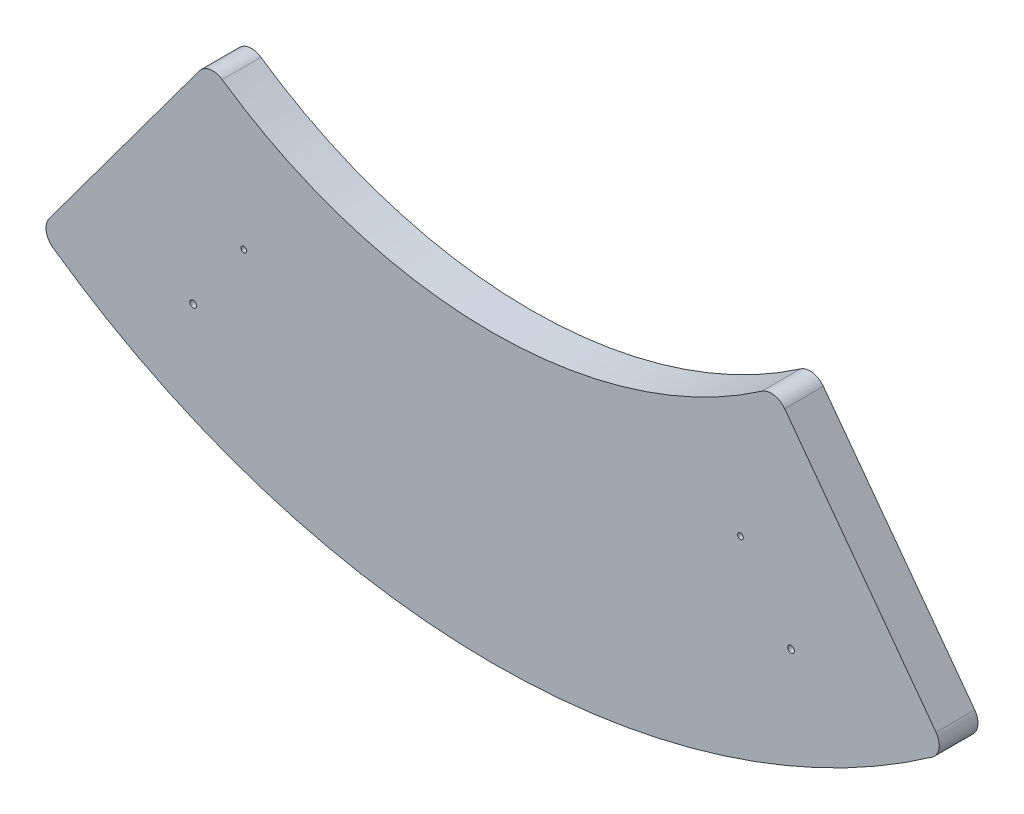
ISO-10303-21;
HEADER;
FILE_DESCRIPTION(('STEP AP214'),'2;1');
FILE_NAME('part.step','',(''),(''),'','','');
FILE_SCHEMA(('AUTOMOTIVE_DESIGN { 1 0 10303 214 1 1 1 1 }'));
ENDSEC;
DATA;
#1=APPLICATION_CONTEXT('core data for automotive mechanical design processes');
#2=APPLICATION_PROTOCOL_DEFINITION('international standard','automotive_design',2000,#1);
#3=PRODUCT_CONTEXT('',#1,'mechanical');
#4=PRODUCT('Part','Part','',(#3));
#5=PRODUCT_RELATED_PRODUCT_CATEGORY('part','',(#4));
#6=PRODUCT_DEFINITION_FORMATION('','',#4);
#7=PRODUCT_DEFINITION_CONTEXT('part definition',#1,'design');
#8=PRODUCT_DEFINITION('design','',#6,#7);
#9=PRODUCT_DEFINITION_SHAPE('','',#8);
#10=(LENGTH_UNIT() NAMED_UNIT(*) SI_UNIT(.MILLI.,.METRE.));
#11=(NAMED_UNIT(*) PLANE_ANGLE_UNIT() SI_UNIT($,.RADIAN.));
#12=(NAMED_UNIT(*) SI_UNIT($,.STERADIAN.) SOLID_ANGLE_UNIT());
#13=UNCERTAINTY_MEASURE_WITH_UNIT(LENGTH_MEASURE(1.E-05),#10,'distance_accuracy_value','');
#14=(GEOMETRIC_REPRESENTATION_CONTEXT(3) GLOBAL_UNCERTAINTY_ASSIGNED_CONTEXT((#13)) GLOBAL_UNIT_ASSIGNED_CONTEXT((#10,
#11,#12)) REPRESENTATION_CONTEXT('',''));
#15=CARTESIAN_POINT('',(0.,0.,0.));
#16=DIRECTION('',(0.,0.,1.));
#17=DIRECTION('',(1.,0.,0.));
#18=AXIS2_PLACEMENT_3D('',#15,#16,#17);
#19=CARTESIAN_POINT('',(-1.18350209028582,36.6623095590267,35.));
#20=DIRECTION('',(0.,0.,1.));
#21=DIRECTION('',(1.,0.,0.));
#22=AXIS2_PLACEMENT_3D('',#19,#20,#21);
#23=PLANE('',#22);
#24=CARTESIAN_POINT('',(269.130497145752,-506.272349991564,35.));
#25=DIRECTION('',(0.,0.,1.));
#26=DIRECTION('',(1.,0.,0.));
#27=AXIS2_PLACEMENT_3D('',#24,#25,#26);
#28=CIRCLE('',#27,3.00000000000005);
#29=CARTESIAN_POINT('',(272.130497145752,-506.272349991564,35.));
#30=VERTEX_POINT('',#29);
#31=EDGE_CURVE('E185',#30,#30,#28,.T.);
#32=ORIENTED_EDGE('',*,*,#31,.F.);
#33=EDGE_LOOP('',(#32));
#34=FACE_BOUND('',#33,.T.);
#35=CARTESIAN_POINT('',(-271.388064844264,-506.272349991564,35.));
#36=DIRECTION('',(0.,0.,1.));
#37=DIRECTION('',(1.,0.,0.));
#38=AXIS2_PLACEMENT_3D('',#35,#36,#37);
#39=CIRCLE('',#38,2.99999999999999);
#40=CARTESIAN_POINT('',(-268.388064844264,-506.272349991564,35.));
#41=VERTEX_POINT('',#40);
#42=EDGE_CURVE('E179',#41,#41,#39,.T.);
#43=ORIENTED_EDGE('',*,*,#42,.F.);
#44=EDGE_LOOP('',(#43));
#45=FACE_BOUND('',#44,.T.);
#46=CARTESIAN_POINT('',(-225.628933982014,-440.651454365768,35.));
#47=DIRECTION('',(0.,0.,1.));
#48=DIRECTION('',(1.,0.,0.));
#49=AXIS2_PLACEMENT_3D('',#46,#47,#48);
#50=CIRCLE('',#49,2.59999999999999);
#51=CARTESIAN_POINT('',(-223.028933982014,-440.651454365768,35.));
#52=VERTEX_POINT('',#51);
#53=EDGE_CURVE('E159',#52,#52,#50,.T.);
#54=ORIENTED_EDGE('',*,*,#53,.F.);
#55=EDGE_LOOP('',(#54));
#56=FACE_BOUND('',#55,.T.);
#57=CARTESIAN_POINT('',(0.342863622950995,37.7885172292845,35.));
#58=DIRECTION('',(0.,0.,1.));
#59=DIRECTION('',(-1.,0.,0.));
#60=AXIS2_PLACEMENT_3D('',#57,#58,#59);
#61=CIRCLE('',#60,690.);
#62=CARTESIAN_POINT('',(-398.122859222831,-525.527617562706,35.));
#63=VERTEX_POINT('',#62);
#64=CARTESIAN_POINT('',(396.757470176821,-526.972901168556,35.));
#65=VERTEX_POINT('',#64);
#66=EDGE_CURVE('E163',#63,#65,#61,.T.);
#67=ORIENTED_EDGE('',*,*,#66,.T.);
#68=CARTESIAN_POINT('',(388.139761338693,-514.695479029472,35.));
#69=DIRECTION('',(0.,0.,1.));
#70=DIRECTION('',(1.,0.,0.));
#71=AXIS2_PLACEMENT_3D('',#68,#69,#70);
#72=CIRCLE('',#71,15.);
#73=CARTESIAN_POINT('',(400.197614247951,-505.773137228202,35.));
#74=VERTEX_POINT('',#73);
#75=EDGE_CURVE('E146',#65,#74,#72,.T.);
#76=ORIENTED_EDGE('',*,*,#75,.T.);
#77=DIRECTION('',(-0.594822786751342,0.803856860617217,0.));
#78=VECTOR('',#77,1.);
#79=CARTESIAN_POINT('',(254.590296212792,-308.996140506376,35.));
#80=LINE('',#79,#78);
#81=CARTESIAN_POINT('',(263.362218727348,-320.850713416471,35.));
#82=VERTEX_POINT('',#81);
#83=EDGE_CURVE('E117',#74,#82,#80,.T.);
#84=ORIENTED_EDGE('',*,*,#83,.T.);
#85=CARTESIAN_POINT('',(251.30436581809,-329.773055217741,35.));
#86=DIRECTION('',(0.,0.,1.));
#87=DIRECTION('',(1.,0.,0.));
#88=AXIS2_PLACEMENT_3D('',#85,#86,#87);
#89=CIRCLE('',#88,15.);
#90=CARTESIAN_POINT('',(242.793538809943,-317.421301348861,35.));
#91=VERTEX_POINT('',#90);
#92=EDGE_CURVE('E144',#82,#91,#89,.T.);
#93=ORIENTED_EDGE('',*,*,#92,.T.);
#94=CARTESIAN_POINT('',(-1.18350209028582,36.6623095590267,35.));
#95=DIRECTION('',(0.,0.,-1.));
#96=DIRECTION('',(1.,0.,0.));
#97=AXIS2_PLACEMENT_3D('',#94,#95,#96);
#98=CIRCLE('',#97,430.);
#99=CARTESIAN_POINT('',(-245.160542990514,-317.421301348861,35.));
#100=VERTEX_POINT('',#99);
#101=EDGE_CURVE('E124',#91,#100,#98,.T.);
#102=ORIENTED_EDGE('',*,*,#101,.T.);
#103=CARTESIAN_POINT('',(-253.671369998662,-329.773055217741,35.));
#104=DIRECTION('',(0.,0.,1.));
#105=DIRECTION('',(1.,0.,0.));
#106=AXIS2_PLACEMENT_3D('',#103,#104,#105);
#107=CIRCLE('',#106,15.);
#108=CARTESIAN_POINT('',(-265.72922290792,-320.850713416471,35.));
#109=VERTEX_POINT('',#108);
#110=EDGE_CURVE('E52',#100,#109,#107,.T.);
#111=ORIENTED_EDGE('',*,*,#110,.T.);
#112=DIRECTION('',(-0.594822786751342,-0.803856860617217,0.));
#113=VECTOR('',#112,1.);
#114=CARTESIAN_POINT('',(-256.957300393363,-308.996140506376,35.));
#115=LINE('',#114,#113);
#116=CARTESIAN_POINT('',(-401.518413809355,-504.359272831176,35.));
#117=VERTEX_POINT('',#116);
#118=EDGE_CURVE('E127',#109,#117,#115,.T.);
#119=ORIENTED_EDGE('',*,*,#118,.T.);
#120=CARTESIAN_POINT('',(-389.460560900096,-513.281614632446,35.));
#121=DIRECTION('',(0.,0.,1.));
#122=DIRECTION('',(1.,0.,0.));
#123=AXIS2_PLACEMENT_3D('',#120,#121,#122);
#124=CIRCLE('',#123,15.);
#125=EDGE_CURVE('E142',#117,#63,#124,.T.);
#126=ORIENTED_EDGE('',*,*,#125,.T.);
#127=EDGE_LOOP('',(#67,#76,#84,#93,#102,#111,#119,#126));
#128=FACE_BOUND('',#127,.T.);
#129=CARTESIAN_POINT('',(223.371366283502,-440.651454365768,35.));
#130=DIRECTION('',(0.,0.,1.));
#131=DIRECTION('',(1.,0.,0.));
#132=AXIS2_PLACEMENT_3D('',#129,#130,#131);
#133=CIRCLE('',#132,2.59999999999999);
#134=CARTESIAN_POINT('',(225.971366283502,-440.651454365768,35.));
#135=VERTEX_POINT('',#134);
#136=EDGE_CURVE('E170',#135,#135,#133,.T.);
#137=ORIENTED_EDGE('',*,*,#136,.F.);
#138=EDGE_LOOP('',(#137));
#139=FACE_BOUND('',#138,.T.);
#140=ADVANCED_FACE('F32',(#34,#45,#56,#128,#139),#23,.T.);
#141=CARTESIAN_POINT('',(-1.18350209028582,36.6623095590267,0.));
#142=DIRECTION('',(0.,0.,1.));
#143=DIRECTION('',(1.,0.,0.));
#144=AXIS2_PLACEMENT_3D('',#141,#142,#143);
#145=PLANE('',#144);
#146=CARTESIAN_POINT('',(269.130497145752,-506.272349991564,0.));
#147=DIRECTION('',(0.,0.,1.));
#148=DIRECTION('',(1.,0.,0.));
#149=AXIS2_PLACEMENT_3D('',#146,#147,#148);
#150=CIRCLE('',#149,3.00000000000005);
#151=CARTESIAN_POINT('',(272.130497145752,-506.272349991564,0.));
#152=VERTEX_POINT('',#151);
#153=EDGE_CURVE('E182',#152,#152,#150,.T.);
#154=ORIENTED_EDGE('',*,*,#153,.T.);
#155=EDGE_LOOP('',(#154));
#156=FACE_BOUND('',#155,.T.);
#157=CARTESIAN_POINT('',(-271.388064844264,-506.272349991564,0.));
#158=DIRECTION('',(0.,0.,1.));
#159=DIRECTION('',(1.,0.,0.));
#160=AXIS2_PLACEMENT_3D('',#157,#158,#159);
#161=CIRCLE('',#160,2.99999999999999);
#162=CARTESIAN_POINT('',(-268.388064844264,-506.272349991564,0.));
#163=VERTEX_POINT('',#162);
#164=EDGE_CURVE('E176',#163,#163,#161,.T.);
#165=ORIENTED_EDGE('',*,*,#164,.T.);
#166=EDGE_LOOP('',(#165));
#167=FACE_BOUND('',#166,.T.);
#168=CARTESIAN_POINT('',(-225.628933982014,-440.651454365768,0.));
#169=DIRECTION('',(0.,0.,1.));
#170=DIRECTION('',(1.,0.,0.));
#171=AXIS2_PLACEMENT_3D('',#168,#169,#170);
#172=CIRCLE('',#171,2.59999999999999);
#173=CARTESIAN_POINT('',(-223.028933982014,-440.651454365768,0.));
#174=VERTEX_POINT('',#173);
#175=EDGE_CURVE('E167',#174,#174,#172,.T.);
#176=ORIENTED_EDGE('',*,*,#175,.T.);
#177=EDGE_LOOP('',(#176));
#178=FACE_BOUND('',#177,.T.);
#179=DIRECTION('',(-0.594822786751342,0.803856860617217,0.));
#180=VECTOR('',#179,1.);
#181=CARTESIAN_POINT('',(254.590296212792,-308.996140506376,0.));
#182=LINE('',#181,#180);
#183=CARTESIAN_POINT('',(400.197614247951,-505.773137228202,0.));
#184=VERTEX_POINT('',#183);
#185=CARTESIAN_POINT('',(263.362218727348,-320.850713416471,0.));
#186=VERTEX_POINT('',#185);
#187=EDGE_CURVE('E114',#184,#186,#182,.T.);
#188=ORIENTED_EDGE('',*,*,#187,.F.);
#189=CARTESIAN_POINT('',(388.139761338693,-514.695479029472,0.));
#190=DIRECTION('',(0.,0.,1.));
#191=DIRECTION('',(1.,0.,0.));
#192=AXIS2_PLACEMENT_3D('',#189,#190,#191);
#193=CIRCLE('',#192,15.);
#194=CARTESIAN_POINT('',(396.757470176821,-526.972901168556,0.));
#195=VERTEX_POINT('',#194);
#196=EDGE_CURVE('E97',#184,#195,#193,.F.);
#197=ORIENTED_EDGE('',*,*,#196,.T.);
#198=CARTESIAN_POINT('',(0.342863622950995,37.7885172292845,0.));
#199=DIRECTION('',(0.,0.,1.));
#200=DIRECTION('',(-1.,0.,0.));
#201=AXIS2_PLACEMENT_3D('',#198,#199,#200);
#202=CIRCLE('',#201,690.);
#203=CARTESIAN_POINT('',(-398.122859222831,-525.527617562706,0.));
#204=VERTEX_POINT('',#203);
#205=EDGE_CURVE('E125',#204,#195,#202,.T.);
#206=ORIENTED_EDGE('',*,*,#205,.F.);
#207=CARTESIAN_POINT('',(-389.460560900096,-513.281614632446,0.));
#208=DIRECTION('',(0.,0.,1.));
#209=DIRECTION('',(1.,0.,0.));
#210=AXIS2_PLACEMENT_3D('',#207,#208,#209);
#211=CIRCLE('',#210,15.);
#212=CARTESIAN_POINT('',(-401.518413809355,-504.359272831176,0.));
#213=VERTEX_POINT('',#212);
#214=EDGE_CURVE('E135',#204,#213,#211,.F.);
#215=ORIENTED_EDGE('',*,*,#214,.T.);
#216=DIRECTION('',(-0.594822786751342,-0.803856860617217,0.));
#217=VECTOR('',#216,1.);
#218=CARTESIAN_POINT('',(-256.957300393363,-308.996140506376,0.));
#219=LINE('',#218,#217);
#220=CARTESIAN_POINT('',(-265.72922290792,-320.850713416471,0.));
#221=VERTEX_POINT('',#220);
#222=EDGE_CURVE('E129',#221,#213,#219,.T.);
#223=ORIENTED_EDGE('',*,*,#222,.F.);
#224=CARTESIAN_POINT('',(-253.671369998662,-329.773055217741,0.));
#225=DIRECTION('',(0.,0.,1.));
#226=DIRECTION('',(1.,0.,0.));
#227=AXIS2_PLACEMENT_3D('',#224,#225,#226);
#228=CIRCLE('',#227,15.);
#229=CARTESIAN_POINT('',(-245.160542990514,-317.421301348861,0.));
#230=VERTEX_POINT('',#229);
#231=EDGE_CURVE('E118',#221,#230,#228,.F.);
#232=ORIENTED_EDGE('',*,*,#231,.T.);
#233=CARTESIAN_POINT('',(-1.18350209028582,36.6623095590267,0.));
#234=DIRECTION('',(0.,0.,-1.));
#235=DIRECTION('',(1.,0.,0.));
#236=AXIS2_PLACEMENT_3D('',#233,#234,#235);
#237=CIRCLE('',#236,430.);
#238=CARTESIAN_POINT('',(242.793538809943,-317.421301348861,0.));
#239=VERTEX_POINT('',#238);
#240=EDGE_CURVE('E158',#239,#230,#237,.T.);
#241=ORIENTED_EDGE('',*,*,#240,.F.);
#242=CARTESIAN_POINT('',(251.30436581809,-329.773055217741,0.));
#243=DIRECTION('',(0.,0.,1.));
#244=DIRECTION('',(1.,0.,0.));
#245=AXIS2_PLACEMENT_3D('',#242,#243,#244);
#246=CIRCLE('',#245,15.);
#247=EDGE_CURVE('E108',#239,#186,#246,.F.);
#248=ORIENTED_EDGE('',*,*,#247,.T.);
#249=EDGE_LOOP('',(#188,#197,#206,#215,#223,#232,#241,#248));
#250=FACE_BOUND('',#249,.T.);
#251=CARTESIAN_POINT('',(223.371366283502,-440.651454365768,0.));
#252=DIRECTION('',(0.,0.,1.));
#253=DIRECTION('',(1.,0.,0.));
#254=AXIS2_PLACEMENT_3D('',#251,#252,#253);
#255=CIRCLE('',#254,2.59999999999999);
#256=CARTESIAN_POINT('',(225.971366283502,-440.651454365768,0.));
#257=VERTEX_POINT('',#256);
#258=EDGE_CURVE('E173',#257,#257,#255,.T.);
#259=ORIENTED_EDGE('',*,*,#258,.T.);
#260=EDGE_LOOP('',(#259));
#261=FACE_BOUND('',#260,.T.);
#262=ADVANCED_FACE('F121',(#156,#167,#178,#250,#261),#145,.F.);
#263=CARTESIAN_POINT('',(-1.18350209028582,36.6623095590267,35.));
#264=DIRECTION('',(0.,0.,-1.));
#265=DIRECTION('',(-1.,0.,0.));
#266=AXIS2_PLACEMENT_3D('',#263,#264,#265);
#267=CYLINDRICAL_SURFACE('',#266,430.);
#268=ORIENTED_EDGE('',*,*,#101,.F.);
#269=DIRECTION('',(0.,0.,-1.));
#270=VECTOR('',#269,1.);
#271=CARTESIAN_POINT('',(242.793538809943,-317.421301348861,35.));
#272=LINE('',#271,#270);
#273=EDGE_CURVE('E150',#91,#239,#272,.T.);
#274=ORIENTED_EDGE('',*,*,#273,.T.);
#275=ORIENTED_EDGE('',*,*,#240,.T.);
#276=DIRECTION('',(0.,0.,-1.));
#277=VECTOR('',#276,1.);
#278=CARTESIAN_POINT('',(-245.160542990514,-317.421301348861,35.));
#279=LINE('',#278,#277);
#280=EDGE_CURVE('E148',#230,#100,#279,.F.);
#281=ORIENTED_EDGE('',*,*,#280,.T.);
#282=EDGE_LOOP('',(#268,#274,#275,#281));
#283=FACE_BOUND('',#282,.T.);
#284=ADVANCED_FACE('F217',(#283),#267,.F.);
#285=CARTESIAN_POINT('',(-256.957300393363,-308.996140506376,35.));
#286=DIRECTION('',(0.803856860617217,-0.594822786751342,0.));
#287=DIRECTION('',(0.594822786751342,0.803856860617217,0.));
#288=AXIS2_PLACEMENT_3D('',#285,#286,#287);
#289=PLANE('',#288);
#290=ORIENTED_EDGE('',*,*,#222,.T.);
#291=DIRECTION('',(0.,0.,-1.));
#292=VECTOR('',#291,1.);
#293=CARTESIAN_POINT('',(-401.518413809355,-504.359272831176,35.));
#294=LINE('',#293,#292);
#295=EDGE_CURVE('E11',#213,#117,#294,.F.);
#296=ORIENTED_EDGE('',*,*,#295,.T.);
#297=ORIENTED_EDGE('',*,*,#118,.F.);
#298=DIRECTION('',(0.,0.,-1.));
#299=VECTOR('',#298,1.);
#300=CARTESIAN_POINT('',(-265.72922290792,-320.850713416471,35.));
#301=LINE('',#300,#299);
#302=EDGE_CURVE('E40',#109,#221,#301,.T.);
#303=ORIENTED_EDGE('',*,*,#302,.T.);
#304=EDGE_LOOP('',(#290,#296,#297,#303));
#305=FACE_BOUND('',#304,.T.);
#306=ADVANCED_FACE('F155',(#305),#289,.F.);
#307=CARTESIAN_POINT('',(0.342863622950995,37.7885172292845,35.));
#308=DIRECTION('',(0.,0.,-1.));
#309=DIRECTION('',(-1.,0.,0.));
#310=AXIS2_PLACEMENT_3D('',#307,#308,#309);
#311=CYLINDRICAL_SURFACE('',#310,690.);
#312=ORIENTED_EDGE('',*,*,#205,.T.);
#313=DIRECTION('',(0.,0.,-1.));
#314=VECTOR('',#313,1.);
#315=CARTESIAN_POINT('',(396.757470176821,-526.972901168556,35.));
#316=LINE('',#315,#314);
#317=EDGE_CURVE('E102',#195,#65,#316,.F.);
#318=ORIENTED_EDGE('',*,*,#317,.T.);
#319=ORIENTED_EDGE('',*,*,#66,.F.);
#320=DIRECTION('',(0.,0.,-1.));
#321=VECTOR('',#320,1.);
#322=CARTESIAN_POINT('',(-398.122859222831,-525.527617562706,35.));
#323=LINE('',#322,#321);
#324=EDGE_CURVE('E107',#63,#204,#323,.T.);
#325=ORIENTED_EDGE('',*,*,#324,.T.);
#326=EDGE_LOOP('',(#312,#318,#319,#325));
#327=FACE_BOUND('',#326,.T.);
#328=ADVANCED_FACE('F228',(#327),#311,.T.);
#329=CARTESIAN_POINT('',(254.590296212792,-308.996140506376,35.));
#330=DIRECTION('',(-0.803856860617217,-0.594822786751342,0.));
#331=DIRECTION('',(0.594822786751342,-0.803856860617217,0.));
#332=AXIS2_PLACEMENT_3D('',#329,#330,#331);
#333=PLANE('',#332);
#334=ORIENTED_EDGE('',*,*,#83,.F.);
#335=DIRECTION('',(0.,0.,-1.));
#336=VECTOR('',#335,1.);
#337=CARTESIAN_POINT('',(400.197614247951,-505.773137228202,35.));
#338=LINE('',#337,#336);
#339=EDGE_CURVE('E101',#74,#184,#338,.T.);
#340=ORIENTED_EDGE('',*,*,#339,.T.);
#341=ORIENTED_EDGE('',*,*,#187,.T.);
#342=DIRECTION('',(0.,0.,-1.));
#343=VECTOR('',#342,1.);
#344=CARTESIAN_POINT('',(263.362218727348,-320.850713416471,35.));
#345=LINE('',#344,#343);
#346=EDGE_CURVE('E119',#186,#82,#345,.F.);
#347=ORIENTED_EDGE('',*,*,#346,.T.);
#348=EDGE_LOOP('',(#334,#340,#341,#347));
#349=FACE_BOUND('',#348,.T.);
#350=ADVANCED_FACE('F113',(#349),#333,.F.);
#351=CARTESIAN_POINT('',(-225.628933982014,-440.651454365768,35.));
#352=DIRECTION('',(0.,0.,-1.));
#353=DIRECTION('',(-1.,0.,0.));
#354=AXIS2_PLACEMENT_3D('',#351,#352,#353);
#355=CYLINDRICAL_SURFACE('',#354,2.59999999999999);
#356=ORIENTED_EDGE('',*,*,#53,.T.);
#357=EDGE_LOOP('',(#356));
#358=FACE_BOUND('',#357,.T.);
#359=ORIENTED_EDGE('',*,*,#175,.F.);
#360=EDGE_LOOP('',(#359));
#361=FACE_BOUND('',#360,.T.);
#362=ADVANCED_FACE('F213',(#358,#361),#355,.F.);
#363=CARTESIAN_POINT('',(223.371366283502,-440.651454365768,35.));
#364=DIRECTION('',(0.,0.,-1.));
#365=DIRECTION('',(-1.,0.,0.));
#366=AXIS2_PLACEMENT_3D('',#363,#364,#365);
#367=CYLINDRICAL_SURFACE('',#366,2.59999999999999);
#368=ORIENTED_EDGE('',*,*,#136,.T.);
#369=EDGE_LOOP('',(#368));
#370=FACE_BOUND('',#369,.T.);
#371=ORIENTED_EDGE('',*,*,#258,.F.);
#372=EDGE_LOOP('',(#371));
#373=FACE_BOUND('',#372,.T.);
#374=ADVANCED_FACE('F210',(#370,#373),#367,.F.);
#375=CARTESIAN_POINT('',(388.139761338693,-514.695479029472,35.));
#376=DIRECTION('',(0.,0.,-1.));
#377=DIRECTION('',(-1.,0.,0.));
#378=AXIS2_PLACEMENT_3D('',#375,#376,#377);
#379=CYLINDRICAL_SURFACE('',#378,15.);
#380=ORIENTED_EDGE('',*,*,#75,.F.);
#381=ORIENTED_EDGE('',*,*,#317,.F.);
#382=ORIENTED_EDGE('',*,*,#196,.F.);
#383=ORIENTED_EDGE('',*,*,#339,.F.);
#384=EDGE_LOOP('',(#380,#381,#382,#383));
#385=FACE_BOUND('',#384,.T.);
#386=ADVANCED_FACE('F100',(#385),#379,.T.);
#387=CARTESIAN_POINT('',(251.30436581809,-329.773055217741,35.));
#388=DIRECTION('',(0.,0.,-1.));
#389=DIRECTION('',(-1.,0.,0.));
#390=AXIS2_PLACEMENT_3D('',#387,#388,#389);
#391=CYLINDRICAL_SURFACE('',#390,15.);
#392=ORIENTED_EDGE('',*,*,#92,.F.);
#393=ORIENTED_EDGE('',*,*,#346,.F.);
#394=ORIENTED_EDGE('',*,*,#247,.F.);
#395=ORIENTED_EDGE('',*,*,#273,.F.);
#396=EDGE_LOOP('',(#392,#393,#394,#395));
#397=FACE_BOUND('',#396,.T.);
#398=ADVANCED_FACE('F236',(#397),#391,.T.);
#399=CARTESIAN_POINT('',(-389.460560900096,-513.281614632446,35.));
#400=DIRECTION('',(0.,0.,-1.));
#401=DIRECTION('',(-1.,0.,0.));
#402=AXIS2_PLACEMENT_3D('',#399,#400,#401);
#403=CYLINDRICAL_SURFACE('',#402,15.);
#404=ORIENTED_EDGE('',*,*,#125,.F.);
#405=ORIENTED_EDGE('',*,*,#295,.F.);
#406=ORIENTED_EDGE('',*,*,#214,.F.);
#407=ORIENTED_EDGE('',*,*,#324,.F.);
#408=EDGE_LOOP('',(#404,#405,#406,#407));
#409=FACE_BOUND('',#408,.T.);
#410=ADVANCED_FACE('F238',(#409),#403,.T.);
#411=CARTESIAN_POINT('',(-253.671369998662,-329.773055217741,35.));
#412=DIRECTION('',(0.,0.,-1.));
#413=DIRECTION('',(-1.,0.,0.));
#414=AXIS2_PLACEMENT_3D('',#411,#412,#413);
#415=CYLINDRICAL_SURFACE('',#414,15.);
#416=ORIENTED_EDGE('',*,*,#110,.F.);
#417=ORIENTED_EDGE('',*,*,#280,.F.);
#418=ORIENTED_EDGE('',*,*,#231,.F.);
#419=ORIENTED_EDGE('',*,*,#302,.F.);
#420=EDGE_LOOP('',(#416,#417,#418,#419));
#421=FACE_BOUND('',#420,.T.);
#422=ADVANCED_FACE('F34',(#421),#415,.T.);
#423=CARTESIAN_POINT('',(-271.388064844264,-506.272349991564,0.));
#424=DIRECTION('',(0.,0.,1.));
#425=DIRECTION('',(1.,0.,0.));
#426=AXIS2_PLACEMENT_3D('',#423,#424,#425);
#427=CYLINDRICAL_SURFACE('',#426,2.99999999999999);
#428=ORIENTED_EDGE('',*,*,#164,.F.);
#429=EDGE_LOOP('',(#428));
#430=FACE_BOUND('',#429,.T.);
#431=ORIENTED_EDGE('',*,*,#42,.T.);
#432=EDGE_LOOP('',(#431));
#433=FACE_BOUND('',#432,.T.);
#434=ADVANCED_FACE('F196',(#430,#433),#427,.F.);
#435=CARTESIAN_POINT('',(269.130497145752,-506.272349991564,0.));
#436=DIRECTION('',(0.,0.,1.));
#437=DIRECTION('',(1.,0.,0.));
#438=AXIS2_PLACEMENT_3D('',#435,#436,#437);
#439=CYLINDRICAL_SURFACE('',#438,3.00000000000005);
#440=ORIENTED_EDGE('',*,*,#153,.F.);
#441=EDGE_LOOP('',(#440));
#442=FACE_BOUND('',#441,.T.);
#443=ORIENTED_EDGE('',*,*,#31,.T.);
#444=EDGE_LOOP('',(#443));
#445=FACE_BOUND('',#444,.T.);
#446=ADVANCED_FACE('F193',(#442,#445),#439,.F.);
#447=CLOSED_SHELL('',(#140,#262,#284,#306,#328,#350,#362,#374,#386,#398,#410,#422,#434,#446));
#448=MANIFOLD_SOLID_BREP('B2',#447);
#449=ADVANCED_BREP_SHAPE_REPRESENTATION('',(#18,#448),#14);
#450=SHAPE_DEFINITION_REPRESENTATION(#9,#449);
ENDSEC;
END-ISO-10303-21;
